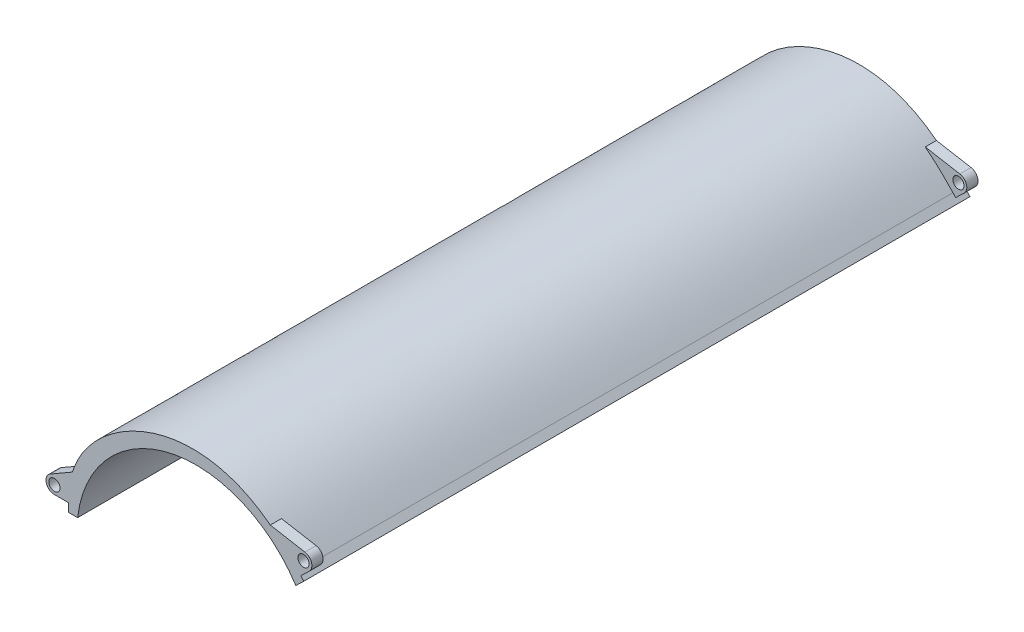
ISO-10303-21;
HEADER;
FILE_DESCRIPTION(('STEP AP214'),'2;1');
FILE_NAME('part.step','',(''),(''),'','','');
FILE_SCHEMA(('AUTOMOTIVE_DESIGN { 1 0 10303 214 1 1 1 1 }'));
ENDSEC;
DATA;
#1=APPLICATION_CONTEXT('core data for automotive mechanical design processes');
#2=APPLICATION_PROTOCOL_DEFINITION('international standard','automotive_design',2000,#1);
#3=PRODUCT_CONTEXT('',#1,'mechanical');
#4=PRODUCT('Part','Part','',(#3));
#5=PRODUCT_RELATED_PRODUCT_CATEGORY('part','',(#4));
#6=PRODUCT_DEFINITION_FORMATION('','',#4);
#7=PRODUCT_DEFINITION_CONTEXT('part definition',#1,'design');
#8=PRODUCT_DEFINITION('design','',#6,#7);
#9=PRODUCT_DEFINITION_SHAPE('','',#8);
#10=(LENGTH_UNIT() NAMED_UNIT(*) SI_UNIT(.MILLI.,.METRE.));
#11=(NAMED_UNIT(*) PLANE_ANGLE_UNIT() SI_UNIT($,.RADIAN.));
#12=(NAMED_UNIT(*) SI_UNIT($,.STERADIAN.) SOLID_ANGLE_UNIT());
#13=UNCERTAINTY_MEASURE_WITH_UNIT(LENGTH_MEASURE(1.E-05),#10,'distance_accuracy_value','');
#14=(GEOMETRIC_REPRESENTATION_CONTEXT(3) GLOBAL_UNCERTAINTY_ASSIGNED_CONTEXT((#13)) GLOBAL_UNIT_ASSIGNED_CONTEXT((#10,
#11,#12)) REPRESENTATION_CONTEXT('',''));
#15=CARTESIAN_POINT('',(0.,0.,0.));
#16=DIRECTION('',(0.,0.,1.));
#17=DIRECTION('',(1.,0.,0.));
#18=AXIS2_PLACEMENT_3D('',#15,#16,#17);
#19=CARTESIAN_POINT('',(-59.3239744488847,128.759639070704,595.));
#20=DIRECTION('',(-0.720870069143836,-0.693070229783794,0.));
#21=DIRECTION('',(0.693070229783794,-0.720870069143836,0.));
#22=AXIS2_PLACEMENT_3D('',#19,#20,#21);
#23=PLANE('',#22);
#24=DIRECTION('',(-0.693070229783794,0.720870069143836,0.));
#25=VECTOR('',#24,1.);
#26=CARTESIAN_POINT('',(-59.3239744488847,128.759639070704,-595.));
#27=LINE('',#26,#25);
#28=CARTESIAN_POINT('',(-59.3239744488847,128.759639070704,-595.));
#29=VERTEX_POINT('',#28);
#30=CARTESIAN_POINT('',(-64.8607561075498,134.51850737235,-595.));
#31=VERTEX_POINT('',#30);
#32=EDGE_CURVE('E464',#29,#31,#27,.T.);
#33=ORIENTED_EDGE('',*,*,#32,.T.);
#34=DIRECTION('',(0.,0.,-1.));
#35=VECTOR('',#34,1.);
#36=CARTESIAN_POINT('',(-64.8607561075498,134.51850737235,-575.));
#37=LINE('',#36,#35);
#38=CARTESIAN_POINT('',(-64.8607561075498,134.51850737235,-575.));
#39=VERTEX_POINT('',#38);
#40=EDGE_CURVE('E57',#39,#31,#37,.T.);
#41=ORIENTED_EDGE('',*,*,#40,.F.);
#42=DIRECTION('',(-0.693070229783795,0.720870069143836,0.));
#43=VECTOR('',#42,1.);
#44=CARTESIAN_POINT('',(-207.944056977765,283.341043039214,-575.));
#45=LINE('',#44,#43);
#46=CARTESIAN_POINT('',(-69.7200278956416,139.572690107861,-575.));
#47=VERTEX_POINT('',#46);
#48=EDGE_CURVE('E215',#39,#47,#45,.T.);
#49=ORIENTED_EDGE('',*,*,#48,.T.);
#50=DIRECTION('',(0.,0.,-1.));
#51=VECTOR('',#50,1.);
#52=CARTESIAN_POINT('',(-69.7200278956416,139.572690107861,595.));
#53=LINE('',#52,#51);
#54=CARTESIAN_POINT('',(-69.7200278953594,139.572690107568,575.));
#55=VERTEX_POINT('',#54);
#56=EDGE_CURVE('E11',#55,#47,#53,.T.);
#57=ORIENTED_EDGE('',*,*,#56,.F.);
#58=DIRECTION('',(0.693070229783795,-0.720870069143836,0.));
#59=VECTOR('',#58,1.);
#60=CARTESIAN_POINT('',(-64.8607561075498,134.51850737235,575.));
#61=LINE('',#60,#59);
#62=CARTESIAN_POINT('',(-64.8607561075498,134.51850737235,575.));
#63=VERTEX_POINT('',#62);
#64=EDGE_CURVE('E439',#55,#63,#61,.T.);
#65=ORIENTED_EDGE('',*,*,#64,.T.);
#66=DIRECTION('',(0.,0.,1.));
#67=VECTOR('',#66,1.);
#68=CARTESIAN_POINT('',(-64.8607561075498,134.51850737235,575.));
#69=LINE('',#68,#67);
#70=CARTESIAN_POINT('',(-64.8607561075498,134.51850737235,595.));
#71=VERTEX_POINT('',#70);
#72=EDGE_CURVE('E414',#63,#71,#69,.T.);
#73=ORIENTED_EDGE('',*,*,#72,.T.);
#74=DIRECTION('',(-0.693070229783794,0.720870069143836,0.));
#75=VECTOR('',#74,1.);
#76=CARTESIAN_POINT('',(-59.3239744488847,128.759639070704,595.));
#77=LINE('',#76,#75);
#78=CARTESIAN_POINT('',(-59.3239744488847,128.759639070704,595.));
#79=VERTEX_POINT('',#78);
#80=EDGE_CURVE('E331',#79,#71,#77,.T.);
#81=ORIENTED_EDGE('',*,*,#80,.F.);
#82=DIRECTION('',(0.,0.,-1.));
#83=VECTOR('',#82,1.);
#84=CARTESIAN_POINT('',(-59.3239744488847,128.759639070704,595.));
#85=LINE('',#84,#83);
#86=EDGE_CURVE('E503',#79,#29,#85,.T.);
#87=ORIENTED_EDGE('',*,*,#86,.T.);
#88=EDGE_LOOP('',(#33,#41,#49,#57,#65,#73,#81,#87));
#89=FACE_BOUND('',#88,.T.);
#90=ADVANCED_FACE('F41',(#89),#23,.F.);
#91=CARTESIAN_POINT('',(-69.7200278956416,139.572690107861,595.));
#92=CARTESIAN_POINT('',(-108.187547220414,179.583185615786,595.));
#93=CARTESIAN_POINT('',(-152.416815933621,225.58654086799,595.));
#94=CARTESIAN_POINT('',(-219.133886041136,251.435560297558,595.));
#95=CARTESIAN_POINT('',(-287.408844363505,253.328836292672,595.));
#96=CARTESIAN_POINT('',(-359.356081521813,236.563554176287,595.));
#97=CARTESIAN_POINT('',(-477.15378099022,170.567422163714,595.));
#98=CARTESIAN_POINT('',(-479.524287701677,50.,595.));
#99=B_SPLINE_CURVE_WITH_KNOTS('',7,(#91,#92,#93,#94,#95,#96,#97,#98),.UNSPECIFIED.,.F.,.F.,(8,
8),(0.,1.),.UNSPECIFIED.);
#100=DIRECTION('',(0.,0.,-1.));
#101=VECTOR('',#100,1.);
#102=SURFACE_OF_LINEAR_EXTRUSION('',#99,#101);
#103=CARTESIAN_POINT('',(-119.307330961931,185.688881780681,-575.));
#104=CARTESIAN_POINT('',(-111.333957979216,179.561593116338,-575.));
#105=CARTESIAN_POINT('',(-103.683856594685,173.1559041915,-575.));
#106=CARTESIAN_POINT('',(-96.3532676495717,166.535005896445,-575.));
#107=CARTESIAN_POINT('',(-89.3294022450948,159.772367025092,-575.));
#108=CARTESIAN_POINT('',(-82.5854794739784,152.954189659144,-575.));
#109=CARTESIAN_POINT('',(-76.0741492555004,146.181682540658,-575.));
#110=CARTESIAN_POINT('',(-69.7200278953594,139.572690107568,-575.));
#111=B_SPLINE_CURVE_WITH_KNOTS('',7,(#103,#104,#105,#106,#107,#108,#109,#110),.UNSPECIFIED.,.F.,
.F.,(8,8),(0.,1.),.UNSPECIFIED.);
#112=CARTESIAN_POINT('',(-119.307330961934,185.688881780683,-575.));
#113=VERTEX_POINT('',#112);
#114=EDGE_CURVE('E64',#113,#47,#111,.T.);
#115=ORIENTED_EDGE('',*,*,#114,.F.);
#116=CARTESIAN_POINT('',(-119.307330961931,185.688881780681,-575.));
#117=DIRECTION('',(0.,0.,-1.));
#118=VECTOR('',#117,1.);
#119=LINE('',#116,#118);
#120=CARTESIAN_POINT('',(-119.307330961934,185.688881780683,-595.));
#121=VERTEX_POINT('',#120);
#122=EDGE_CURVE('E203',#113,#121,#119,.T.);
#123=ORIENTED_EDGE('',*,*,#122,.T.);
#124=CARTESIAN_POINT('',(-69.7200278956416,139.572690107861,-595.));
#125=CARTESIAN_POINT('',(-108.187547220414,179.583185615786,-595.));
#126=CARTESIAN_POINT('',(-152.416815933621,225.58654086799,-595.));
#127=CARTESIAN_POINT('',(-219.133886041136,251.435560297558,-595.));
#128=CARTESIAN_POINT('',(-287.408844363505,253.328836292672,-595.));
#129=CARTESIAN_POINT('',(-359.356081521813,236.563554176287,-595.));
#130=CARTESIAN_POINT('',(-477.15378099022,170.567422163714,-595.));
#131=CARTESIAN_POINT('',(-479.524287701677,50.,-595.));
#132=B_SPLINE_CURVE_WITH_KNOTS('',7,(#124,#125,#126,#127,#128,#129,#130,#131),.UNSPECIFIED.,.F.,
.F.,(8,8),(0.,1.),.UNSPECIFIED.);
#133=CARTESIAN_POINT('',(-472.826933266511,90.8956367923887,-595.));
#134=VERTEX_POINT('',#133);
#135=EDGE_CURVE('E515',#121,#134,#132,.T.);
#136=ORIENTED_EDGE('',*,*,#135,.T.);
#137=DIRECTION('',(0.,0.,-1.));
#138=VECTOR('',#137,1.);
#139=CARTESIAN_POINT('',(-472.826933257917,90.8956368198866,-575.));
#140=LINE('',#139,#138);
#141=CARTESIAN_POINT('',(-472.82693326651,90.8956367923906,-575.));
#142=VERTEX_POINT('',#141);
#143=EDGE_CURVE('E413',#142,#134,#140,.T.);
#144=ORIENTED_EDGE('',*,*,#143,.F.);
#145=CARTESIAN_POINT('',(-479.524287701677,50.0000000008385,-575.));
#146=CARTESIAN_POINT('',(-479.40077470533,56.2820507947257,-575.));
#147=CARTESIAN_POINT('',(-478.963896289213,62.4159497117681,-575.));
#148=CARTESIAN_POINT('',(-478.236465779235,68.4024521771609,-575.));
#149=CARTESIAN_POINT('',(-477.239796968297,74.2424995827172,-575.));
#150=CARTESIAN_POINT('',(-475.993797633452,79.9371958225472,-575.));
#151=CARTESIAN_POINT('',(-474.517057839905,85.4877859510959,-575.));
#152=CARTESIAN_POINT('',(-472.826933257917,90.8956368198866,-575.));
#153=B_SPLINE_CURVE_WITH_KNOTS('',7,(#145,#146,#147,#148,#149,#150,#151,#152),.UNSPECIFIED.,.F.,
.F.,(8,8),(0.,1.),.UNSPECIFIED.);
#154=CARTESIAN_POINT('',(-479.524287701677,50.,-575.));
#155=VERTEX_POINT('',#154);
#156=EDGE_CURVE('E393',#155,#142,#153,.T.);
#157=ORIENTED_EDGE('',*,*,#156,.F.);
#158=DIRECTION('',(0.,0.,-1.));
#159=VECTOR('',#158,1.);
#160=CARTESIAN_POINT('',(-479.524287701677,50.,595.));
#161=LINE('',#160,#159);
#162=CARTESIAN_POINT('',(-479.524287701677,50.0000000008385,575.));
#163=VERTEX_POINT('',#162);
#164=EDGE_CURVE('E49',#163,#155,#161,.T.);
#165=ORIENTED_EDGE('',*,*,#164,.F.);
#166=CARTESIAN_POINT('',(-479.524287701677,50.0000000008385,575.));
#167=CARTESIAN_POINT('',(-479.40077470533,56.2820507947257,575.));
#168=CARTESIAN_POINT('',(-478.963896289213,62.4159497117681,575.));
#169=CARTESIAN_POINT('',(-478.236465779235,68.4024521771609,575.));
#170=CARTESIAN_POINT('',(-477.239796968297,74.2424995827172,575.));
#171=CARTESIAN_POINT('',(-475.993797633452,79.9371958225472,575.));
#172=CARTESIAN_POINT('',(-474.517057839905,85.4877859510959,575.));
#173=CARTESIAN_POINT('',(-472.826933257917,90.8956368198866,575.));
#174=B_SPLINE_CURVE_WITH_KNOTS('',7,(#166,#167,#168,#169,#170,#171,#172,#173),.UNSPECIFIED.,.F.,
.F.,(8,8),(0.94789595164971,1.),.UNSPECIFIED.);
#175=CARTESIAN_POINT('',(-472.826933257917,90.8956368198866,575.));
#176=VERTEX_POINT('',#175);
#177=EDGE_CURVE('E301',#163,#176,#174,.T.);
#178=ORIENTED_EDGE('',*,*,#177,.T.);
#179=CARTESIAN_POINT('',(-472.826933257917,90.8956368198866,575.));
#180=DIRECTION('',(0.,0.,1.));
#181=VECTOR('',#180,1.);
#182=LINE('',#179,#181);
#183=CARTESIAN_POINT('',(-472.826933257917,90.8956368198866,595.));
#184=VERTEX_POINT('',#183);
#185=EDGE_CURVE('E465',#176,#184,#182,.T.);
#186=ORIENTED_EDGE('',*,*,#185,.T.);
#187=CARTESIAN_POINT('',(-119.307330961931,185.688881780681,595.));
#188=VERTEX_POINT('',#187);
#189=EDGE_CURVE('E328',#188,#184,#99,.T.);
#190=ORIENTED_EDGE('',*,*,#189,.F.);
#191=DIRECTION('',(0.,0.,1.));
#192=VECTOR('',#191,1.);
#193=CARTESIAN_POINT('',(-119.307330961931,185.688881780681,575.));
#194=LINE('',#193,#192);
#195=CARTESIAN_POINT('',(-119.307330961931,185.688881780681,575.));
#196=VERTEX_POINT('',#195);
#197=EDGE_CURVE('E422',#196,#188,#194,.T.);
#198=ORIENTED_EDGE('',*,*,#197,.F.);
#199=CARTESIAN_POINT('',(-119.307330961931,185.688881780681,575.));
#200=CARTESIAN_POINT('',(-111.333957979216,179.561593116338,575.));
#201=CARTESIAN_POINT('',(-103.683856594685,173.1559041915,575.));
#202=CARTESIAN_POINT('',(-96.3532676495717,166.535005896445,575.));
#203=CARTESIAN_POINT('',(-89.3294022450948,159.772367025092,575.));
#204=CARTESIAN_POINT('',(-82.5854794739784,152.954189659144,575.));
#205=CARTESIAN_POINT('',(-76.0741492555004,146.181682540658,575.));
#206=CARTESIAN_POINT('',(-69.7200278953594,139.572690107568,575.));
#207=B_SPLINE_CURVE_WITH_KNOTS('',7,(#199,#200,#201,#202,#203,#204,#205,#206),.UNSPECIFIED.,.F.,
.F.,(8,8),(0.,0.165181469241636),.UNSPECIFIED.);
#208=EDGE_CURVE('E548',#196,#55,#207,.T.);
#209=ORIENTED_EDGE('',*,*,#208,.T.);
#210=ORIENTED_EDGE('',*,*,#56,.T.);
#211=EDGE_LOOP('',(#115,#123,#136,#144,#157,#165,#178,#186,#190,#198,#209,#210));
#212=FACE_BOUND('',#211,.T.);
#213=ADVANCED_FACE('F345',(#212),#102,.F.);
#214=CARTESIAN_POINT('',(-479.524287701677,25.,595.));
#215=DIRECTION('',(1.,0.,0.));
#216=DIRECTION('',(0.,1.,0.));
#217=AXIS2_PLACEMENT_3D('',#214,#215,#216);
#218=PLANE('',#217);
#219=DIRECTION('',(0.,-1.,0.));
#220=VECTOR('',#219,1.);
#221=CARTESIAN_POINT('',(-479.524287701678,234.472912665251,-575.));
#222=LINE('',#221,#220);
#223=CARTESIAN_POINT('',(-479.524287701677,40.,-575.));
#224=VERTEX_POINT('',#223);
#225=EDGE_CURVE('E399',#155,#224,#222,.T.);
#226=ORIENTED_EDGE('',*,*,#225,.T.);
#227=DIRECTION('',(0.,0.,-1.));
#228=VECTOR('',#227,1.);
#229=CARTESIAN_POINT('',(-479.524287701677,40.,-575.));
#230=LINE('',#229,#228);
#231=CARTESIAN_POINT('',(-479.524287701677,40.,-595.));
#232=VERTEX_POINT('',#231);
#233=EDGE_CURVE('E406',#224,#232,#230,.T.);
#234=ORIENTED_EDGE('',*,*,#233,.T.);
#235=DIRECTION('',(0.,-1.,0.));
#236=VECTOR('',#235,1.);
#237=CARTESIAN_POINT('',(-479.524287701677,25.,-595.));
#238=LINE('',#237,#236);
#239=CARTESIAN_POINT('',(-479.524287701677,25.,-595.));
#240=VERTEX_POINT('',#239);
#241=EDGE_CURVE('E513',#232,#240,#238,.T.);
#242=ORIENTED_EDGE('',*,*,#241,.T.);
#243=DIRECTION('',(0.,0.,-1.));
#244=VECTOR('',#243,1.);
#245=CARTESIAN_POINT('',(-479.524287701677,25.,595.));
#246=LINE('',#245,#244);
#247=CARTESIAN_POINT('',(-479.524287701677,25.,595.));
#248=VERTEX_POINT('',#247);
#249=EDGE_CURVE('E491',#248,#240,#246,.T.);
#250=ORIENTED_EDGE('',*,*,#249,.F.);
#251=DIRECTION('',(0.,-1.,0.));
#252=VECTOR('',#251,1.);
#253=CARTESIAN_POINT('',(-479.524287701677,25.,595.));
#254=LINE('',#253,#252);
#255=CARTESIAN_POINT('',(-479.524287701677,40.,595.));
#256=VERTEX_POINT('',#255);
#257=EDGE_CURVE('E330',#256,#248,#254,.T.);
#258=ORIENTED_EDGE('',*,*,#257,.F.);
#259=DIRECTION('',(0.,0.,1.));
#260=VECTOR('',#259,1.);
#261=CARTESIAN_POINT('',(-479.524287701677,40.,575.));
#262=LINE('',#261,#260);
#263=CARTESIAN_POINT('',(-479.524287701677,40.,575.));
#264=VERTEX_POINT('',#263);
#265=EDGE_CURVE('E466',#264,#256,#262,.T.);
#266=ORIENTED_EDGE('',*,*,#265,.F.);
#267=DIRECTION('',(0.,1.,0.));
#268=VECTOR('',#267,1.);
#269=CARTESIAN_POINT('',(-479.524287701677,50.0000000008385,575.));
#270=LINE('',#269,#268);
#271=EDGE_CURVE('E310',#264,#163,#270,.T.);
#272=ORIENTED_EDGE('',*,*,#271,.T.);
#273=ORIENTED_EDGE('',*,*,#164,.T.);
#274=EDGE_LOOP('',(#226,#234,#242,#250,#258,#266,#272,#273));
#275=FACE_BOUND('',#274,.T.);
#276=ADVANCED_FACE('F349',(#275),#218,.F.);
#277=CARTESIAN_POINT('',(-463.524287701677,25.,595.));
#278=DIRECTION('',(0.,1.,0.));
#279=DIRECTION('',(0.,0.,1.));
#280=AXIS2_PLACEMENT_3D('',#277,#278,#279);
#281=PLANE('',#280);
#282=DIRECTION('',(1.,0.,0.));
#283=VECTOR('',#282,1.);
#284=CARTESIAN_POINT('',(-463.524287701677,25.,-595.));
#285=LINE('',#284,#283);
#286=CARTESIAN_POINT('',(-463.524287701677,25.0000000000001,-595.));
#287=VERTEX_POINT('',#286);
#288=EDGE_CURVE('E511',#240,#287,#285,.T.);
#289=ORIENTED_EDGE('',*,*,#288,.T.);
#290=DIRECTION('',(0.,0.,-1.));
#291=VECTOR('',#290,1.);
#292=CARTESIAN_POINT('',(-463.524287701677,25.0000000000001,595.));
#293=LINE('',#292,#291);
#294=CARTESIAN_POINT('',(-463.524287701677,25.0000000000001,595.));
#295=VERTEX_POINT('',#294);
#296=EDGE_CURVE('E497',#295,#287,#293,.T.);
#297=ORIENTED_EDGE('',*,*,#296,.F.);
#298=DIRECTION('',(1.,0.,0.));
#299=VECTOR('',#298,1.);
#300=CARTESIAN_POINT('',(-463.524287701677,25.,595.));
#301=LINE('',#300,#299);
#302=EDGE_CURVE('E590',#248,#295,#301,.T.);
#303=ORIENTED_EDGE('',*,*,#302,.F.);
#304=ORIENTED_EDGE('',*,*,#249,.T.);
#305=EDGE_LOOP('',(#289,#297,#303,#304));
#306=FACE_BOUND('',#305,.T.);
#307=ADVANCED_FACE('F589',(#306),#281,.F.);
#308=CARTESIAN_POINT('',(-252.5,1.52655665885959E-13,595.));
#309=DIRECTION('',(0.,0.,-1.));
#310=DIRECTION('',(-1.,0.,0.));
#311=AXIS2_PLACEMENT_3D('',#308,#309,#310);
#312=CYLINDRICAL_SURFACE('',#311,212.5);
#313=CARTESIAN_POINT('',(-252.5,1.52655665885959E-13,-595.));
#314=DIRECTION('',(0.,0.,-1.));
#315=DIRECTION('',(1.,0.,0.));
#316=AXIS2_PLACEMENT_3D('',#313,#314,#315);
#317=CIRCLE('',#316,212.5);
#318=CARTESIAN_POINT('',(-73.7413758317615,114.898234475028,-595.));
#319=VERTEX_POINT('',#318);
#320=EDGE_CURVE('E509',#287,#319,#317,.T.);
#321=ORIENTED_EDGE('',*,*,#320,.T.);
#322=DIRECTION('',(0.,0.,-1.));
#323=VECTOR('',#322,1.);
#324=CARTESIAN_POINT('',(-73.7413758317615,114.898234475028,595.));
#325=LINE('',#324,#323);
#326=CARTESIAN_POINT('',(-73.7413758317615,114.898234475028,595.));
#327=VERTEX_POINT('',#326);
#328=EDGE_CURVE('E500',#327,#319,#325,.T.);
#329=ORIENTED_EDGE('',*,*,#328,.F.);
#330=CARTESIAN_POINT('',(-252.5,1.52655665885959E-13,595.));
#331=DIRECTION('',(0.,0.,-1.));
#332=DIRECTION('',(1.,0.,0.));
#333=AXIS2_PLACEMENT_3D('',#330,#331,#332);
#334=CIRCLE('',#333,212.5);
#335=EDGE_CURVE('E585',#295,#327,#334,.T.);
#336=ORIENTED_EDGE('',*,*,#335,.F.);
#337=ORIENTED_EDGE('',*,*,#296,.T.);
#338=EDGE_LOOP('',(#321,#329,#336,#337));
#339=FACE_BOUND('',#338,.T.);
#340=ADVANCED_FACE('F584',(#339),#312,.F.);
#341=CARTESIAN_POINT('',(-59.3239744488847,128.759639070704,595.));
#342=DIRECTION('',(-0.693070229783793,0.720870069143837,0.));
#343=DIRECTION('',(-0.720870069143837,-0.693070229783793,0.));
#344=AXIS2_PLACEMENT_3D('',#341,#342,#343);
#345=PLANE('',#344);
#346=DIRECTION('',(0.720870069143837,0.693070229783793,0.));
#347=VECTOR('',#346,1.);
#348=CARTESIAN_POINT('',(-59.3239744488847,128.759639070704,-595.));
#349=LINE('',#348,#347);
#350=EDGE_CURVE('E507',#319,#29,#349,.T.);
#351=ORIENTED_EDGE('',*,*,#350,.T.);
#352=ORIENTED_EDGE('',*,*,#86,.F.);
#353=DIRECTION('',(0.720870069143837,0.693070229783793,0.));
#354=VECTOR('',#353,1.);
#355=CARTESIAN_POINT('',(-59.3239744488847,128.759639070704,595.));
#356=LINE('',#355,#354);
#357=EDGE_CURVE('E506',#327,#79,#356,.T.);
#358=ORIENTED_EDGE('',*,*,#357,.F.);
#359=ORIENTED_EDGE('',*,*,#328,.T.);
#360=EDGE_LOOP('',(#351,#352,#358,#359));
#361=FACE_BOUND('',#360,.T.);
#362=ADVANCED_FACE('F580',(#361),#345,.F.);
#363=CARTESIAN_POINT('',(-258.772343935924,234.472912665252,595.));
#364=DIRECTION('',(0.,0.,-1.));
#365=DIRECTION('',(-1.,0.,0.));
#366=AXIS2_PLACEMENT_3D('',#363,#364,#365);
#367=PLANE('',#366);
#368=DIRECTION('',(-0.984807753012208,0.173648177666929,0.));
#369=VECTOR('',#368,1.);
#370=CARTESIAN_POINT('',(-57.3952773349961,174.772116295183,595.));
#371=LINE('',#370,#369);
#372=CARTESIAN_POINT('',(-57.3952773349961,174.772116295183,595.));
#373=VERTEX_POINT('',#372);
#374=EDGE_CURVE('E427',#373,#188,#371,.T.);
#375=ORIENTED_EDGE('',*,*,#374,.T.);
#376=ORIENTED_EDGE('',*,*,#189,.T.);
#377=DIRECTION('',(-0.866025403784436,-0.500000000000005,0.));
#378=VECTOR('',#377,1.);
#379=CARTESIAN_POINT('',(-512.5,67.9903810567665,595.));
#380=LINE('',#379,#378);
#381=CARTESIAN_POINT('',(-512.5,67.9903810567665,595.));
#382=VERTEX_POINT('',#381);
#383=EDGE_CURVE('E455',#184,#382,#380,.T.);
#384=ORIENTED_EDGE('',*,*,#383,.T.);
#385=CARTESIAN_POINT('',(-505.,55.,595.));
#386=DIRECTION('',(0.,0.,1.));
#387=DIRECTION('',(1.,0.,0.));
#388=AXIS2_PLACEMENT_3D('',#385,#386,#387);
#389=CIRCLE('',#388,15.);
#390=CARTESIAN_POINT('',(-505.,40.,595.));
#391=VERTEX_POINT('',#390);
#392=EDGE_CURVE('E449',#382,#391,#389,.T.);
#393=ORIENTED_EDGE('',*,*,#392,.T.);
#394=DIRECTION('',(1.,0.,0.));
#395=VECTOR('',#394,1.);
#396=CARTESIAN_POINT('',(-505.,40.,595.));
#397=LINE('',#396,#395);
#398=EDGE_CURVE('E460',#391,#256,#397,.T.);
#399=ORIENTED_EDGE('',*,*,#398,.T.);
#400=ORIENTED_EDGE('',*,*,#257,.T.);
#401=ORIENTED_EDGE('',*,*,#302,.T.);
#402=ORIENTED_EDGE('',*,*,#335,.T.);
#403=ORIENTED_EDGE('',*,*,#357,.T.);
#404=ORIENTED_EDGE('',*,*,#80,.T.);
#405=DIRECTION('',(0.720870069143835,0.693070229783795,0.));
#406=VECTOR('',#405,1.);
#407=CARTESIAN_POINT('',(-49.6039465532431,149.186948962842,595.));
#408=LINE('',#407,#406);
#409=CARTESIAN_POINT('',(-49.6039465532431,149.186948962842,595.));
#410=VERTEX_POINT('',#409);
#411=EDGE_CURVE('E426',#71,#410,#408,.T.);
#412=ORIENTED_EDGE('',*,*,#411,.T.);
#413=CARTESIAN_POINT('',(-60.0000000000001,160.,595.));
#414=DIRECTION('',(0.,0.,1.));
#415=DIRECTION('',(1.,0.,0.));
#416=AXIS2_PLACEMENT_3D('',#413,#414,#415);
#417=CIRCLE('',#416,15.);
#418=EDGE_CURVE('E423',#410,#373,#417,.T.);
#419=ORIENTED_EDGE('',*,*,#418,.T.);
#420=EDGE_LOOP('',(#375,#376,#384,#393,#399,#400,#401,#402,#403,#404,#412,#419));
#421=FACE_BOUND('',#420,.T.);
#422=CARTESIAN_POINT('',(-505.,55.,595.));
#423=DIRECTION('',(0.,0.,1.));
#424=DIRECTION('',(1.,0.,0.));
#425=AXIS2_PLACEMENT_3D('',#422,#423,#424);
#426=CIRCLE('',#425,9.99999999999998);
#427=CARTESIAN_POINT('',(-495.,55.,595.));
#428=VERTEX_POINT('',#427);
#429=EDGE_CURVE('E443',#428,#428,#426,.T.);
#430=ORIENTED_EDGE('',*,*,#429,.F.);
#431=EDGE_LOOP('',(#430));
#432=FACE_BOUND('',#431,.T.);
#433=CARTESIAN_POINT('',(-60.0000000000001,160.,595.));
#434=DIRECTION('',(0.,0.,1.));
#435=DIRECTION('',(1.,0.,0.));
#436=AXIS2_PLACEMENT_3D('',#433,#434,#435);
#437=CIRCLE('',#436,9.99999999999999);
#438=CARTESIAN_POINT('',(-50.0000000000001,160.,595.));
#439=VERTEX_POINT('',#438);
#440=EDGE_CURVE('E440',#439,#439,#437,.T.);
#441=ORIENTED_EDGE('',*,*,#440,.F.);
#442=EDGE_LOOP('',(#441));
#443=FACE_BOUND('',#442,.T.);
#444=ADVANCED_FACE('F479',(#421,#432,#443),#367,.F.);
#445=CARTESIAN_POINT('',(-258.772343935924,234.472912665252,-595.));
#446=DIRECTION('',(0.,0.,-1.));
#447=DIRECTION('',(-1.,0.,0.));
#448=AXIS2_PLACEMENT_3D('',#445,#446,#447);
#449=PLANE('',#448);
#450=ORIENTED_EDGE('',*,*,#135,.F.);
#451=DIRECTION('',(0.984807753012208,-0.173648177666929,0.));
#452=VECTOR('',#451,1.);
#453=CARTESIAN_POINT('',(-262.909519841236,211.009822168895,-595.));
#454=LINE('',#453,#452);
#455=CARTESIAN_POINT('',(-57.395277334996,174.772116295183,-595.));
#456=VERTEX_POINT('',#455);
#457=EDGE_CURVE('E227',#121,#456,#454,.T.);
#458=ORIENTED_EDGE('',*,*,#457,.T.);
#459=CARTESIAN_POINT('',(-60.0000000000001,160.,-595.));
#460=DIRECTION('',(0.,0.,-1.));
#461=DIRECTION('',(-1.,0.,0.));
#462=AXIS2_PLACEMENT_3D('',#459,#460,#461);
#463=CIRCLE('',#462,15.);
#464=CARTESIAN_POINT('',(-49.6039465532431,149.186948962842,-595.));
#465=VERTEX_POINT('',#464);
#466=EDGE_CURVE('E197',#456,#465,#463,.T.);
#467=ORIENTED_EDGE('',*,*,#466,.T.);
#468=DIRECTION('',(-0.720870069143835,-0.693070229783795,0.));
#469=VECTOR('',#468,1.);
#470=CARTESIAN_POINT('',(-115.689043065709,85.6503769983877,-595.));
#471=LINE('',#470,#469);
#472=EDGE_CURVE('E369',#465,#31,#471,.T.);
#473=ORIENTED_EDGE('',*,*,#472,.T.);
#474=ORIENTED_EDGE('',*,*,#32,.F.);
#475=ORIENTED_EDGE('',*,*,#350,.F.);
#476=ORIENTED_EDGE('',*,*,#320,.F.);
#477=ORIENTED_EDGE('',*,*,#288,.F.);
#478=ORIENTED_EDGE('',*,*,#241,.F.);
#479=DIRECTION('',(-1.,0.,0.));
#480=VECTOR('',#479,1.);
#481=CARTESIAN_POINT('',(-258.772343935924,40.,-595.));
#482=LINE('',#481,#480);
#483=CARTESIAN_POINT('',(-505.,40.,-595.));
#484=VERTEX_POINT('',#483);
#485=EDGE_CURVE('E403',#232,#484,#482,.T.);
#486=ORIENTED_EDGE('',*,*,#485,.T.);
#487=CARTESIAN_POINT('',(-505.,55.,-595.));
#488=DIRECTION('',(0.,0.,-1.));
#489=DIRECTION('',(-1.,0.,0.));
#490=AXIS2_PLACEMENT_3D('',#487,#488,#489);
#491=CIRCLE('',#490,15.);
#492=CARTESIAN_POINT('',(-512.5,67.9903810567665,-595.));
#493=VERTEX_POINT('',#492);
#494=EDGE_CURVE('E400',#484,#493,#491,.T.);
#495=ORIENTED_EDGE('',*,*,#494,.T.);
#496=DIRECTION('',(0.866025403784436,0.500000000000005,0.));
#497=VECTOR('',#496,1.);
#498=CARTESIAN_POINT('',(-250.115207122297,219.478311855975,-595.));
#499=LINE('',#498,#497);
#500=EDGE_CURVE('E386',#493,#134,#499,.T.);
#501=ORIENTED_EDGE('',*,*,#500,.T.);
#502=EDGE_LOOP('',(#450,#458,#467,#473,#474,#475,#476,#477,#478,#486,#495,#501));
#503=FACE_BOUND('',#502,.T.);
#504=CARTESIAN_POINT('',(-505.,55.,-595.));
#505=DIRECTION('',(0.,0.,-1.));
#506=DIRECTION('',(-1.,0.,0.));
#507=AXIS2_PLACEMENT_3D('',#504,#505,#506);
#508=CIRCLE('',#507,9.99999999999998);
#509=CARTESIAN_POINT('',(-515.,55.,-595.));
#510=VERTEX_POINT('',#509);
#511=EDGE_CURVE('E381',#510,#510,#508,.T.);
#512=ORIENTED_EDGE('',*,*,#511,.F.);
#513=EDGE_LOOP('',(#512));
#514=FACE_BOUND('',#513,.T.);
#515=CARTESIAN_POINT('',(-60.0000000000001,160.,-595.));
#516=DIRECTION('',(0.,0.,-1.));
#517=DIRECTION('',(-1.,0.,0.));
#518=AXIS2_PLACEMENT_3D('',#515,#516,#517);
#519=CIRCLE('',#518,9.99999999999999);
#520=CARTESIAN_POINT('',(-70.,160.,-595.));
#521=VERTEX_POINT('',#520);
#522=EDGE_CURVE('E604',#521,#521,#519,.T.);
#523=ORIENTED_EDGE('',*,*,#522,.F.);
#524=EDGE_LOOP('',(#523));
#525=FACE_BOUND('',#524,.T.);
#526=ADVANCED_FACE('F576',(#503,#514,#525),#449,.T.);
#527=CARTESIAN_POINT('',(-505.,55.,575.));
#528=DIRECTION('',(0.,0.,1.));
#529=DIRECTION('',(1.,0.,0.));
#530=AXIS2_PLACEMENT_3D('',#527,#528,#529);
#531=CYLINDRICAL_SURFACE('',#530,15.);
#532=ORIENTED_EDGE('',*,*,#392,.F.);
#533=DIRECTION('',(0.,0.,1.));
#534=VECTOR('',#533,1.);
#535=CARTESIAN_POINT('',(-512.5,67.9903810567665,575.));
#536=LINE('',#535,#534);
#537=CARTESIAN_POINT('',(-512.5,67.9903810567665,575.));
#538=VERTEX_POINT('',#537);
#539=EDGE_CURVE('E462',#538,#382,#536,.T.);
#540=ORIENTED_EDGE('',*,*,#539,.F.);
#541=CARTESIAN_POINT('',(-505.,55.,575.));
#542=DIRECTION('',(0.,0.,1.));
#543=DIRECTION('',(1.,0.,0.));
#544=AXIS2_PLACEMENT_3D('',#541,#542,#543);
#545=CIRCLE('',#544,15.);
#546=CARTESIAN_POINT('',(-505.,40.,575.));
#547=VERTEX_POINT('',#546);
#548=EDGE_CURVE('E452',#538,#547,#545,.T.);
#549=ORIENTED_EDGE('',*,*,#548,.T.);
#550=DIRECTION('',(0.,0.,1.));
#551=VECTOR('',#550,1.);
#552=CARTESIAN_POINT('',(-505.,40.,575.));
#553=LINE('',#552,#551);
#554=EDGE_CURVE('E320',#547,#391,#553,.T.);
#555=ORIENTED_EDGE('',*,*,#554,.T.);
#556=EDGE_LOOP('',(#532,#540,#549,#555));
#557=FACE_BOUND('',#556,.T.);
#558=ADVANCED_FACE('F292',(#557),#531,.T.);
#559=CARTESIAN_POINT('',(-512.5,67.9903810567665,575.));
#560=DIRECTION('',(-0.500000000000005,0.866025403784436,0.));
#561=DIRECTION('',(-0.866025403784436,-0.500000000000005,0.));
#562=AXIS2_PLACEMENT_3D('',#559,#560,#561);
#563=PLANE('',#562);
#564=ORIENTED_EDGE('',*,*,#383,.F.);
#565=ORIENTED_EDGE('',*,*,#185,.F.);
#566=DIRECTION('',(-0.866025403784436,-0.500000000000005,0.));
#567=VECTOR('',#566,1.);
#568=CARTESIAN_POINT('',(-512.5,67.9903810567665,575.));
#569=LINE('',#568,#567);
#570=EDGE_CURVE('E309',#176,#538,#569,.T.);
#571=ORIENTED_EDGE('',*,*,#570,.T.);
#572=ORIENTED_EDGE('',*,*,#539,.T.);
#573=EDGE_LOOP('',(#564,#565,#571,#572));
#574=FACE_BOUND('',#573,.T.);
#575=ADVANCED_FACE('F288',(#574),#563,.T.);
#576=CARTESIAN_POINT('',(-505.,40.,575.));
#577=DIRECTION('',(0.,-1.,0.));
#578=DIRECTION('',(0.,0.,-1.));
#579=AXIS2_PLACEMENT_3D('',#576,#577,#578);
#580=PLANE('',#579);
#581=ORIENTED_EDGE('',*,*,#398,.F.);
#582=ORIENTED_EDGE('',*,*,#554,.F.);
#583=DIRECTION('',(1.,0.,0.));
#584=VECTOR('',#583,1.);
#585=CARTESIAN_POINT('',(-505.,40.,575.));
#586=LINE('',#585,#584);
#587=EDGE_CURVE('E325',#547,#264,#586,.T.);
#588=ORIENTED_EDGE('',*,*,#587,.T.);
#589=ORIENTED_EDGE('',*,*,#265,.T.);
#590=EDGE_LOOP('',(#581,#582,#588,#589));
#591=FACE_BOUND('',#590,.T.);
#592=ADVANCED_FACE('F286',(#591),#580,.T.);
#593=CARTESIAN_POINT('',(-505.,55.,575.));
#594=DIRECTION('',(0.,0.,1.));
#595=DIRECTION('',(1.,0.,0.));
#596=AXIS2_PLACEMENT_3D('',#593,#594,#595);
#597=PLANE('',#596);
#598=CARTESIAN_POINT('',(-505.,55.,575.));
#599=DIRECTION('',(0.,0.,1.));
#600=DIRECTION('',(1.,0.,0.));
#601=AXIS2_PLACEMENT_3D('',#598,#599,#600);
#602=CIRCLE('',#601,9.99999999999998);
#603=CARTESIAN_POINT('',(-495.,55.,575.));
#604=VERTEX_POINT('',#603);
#605=EDGE_CURVE('E446',#604,#604,#602,.T.);
#606=ORIENTED_EDGE('',*,*,#605,.T.);
#607=EDGE_LOOP('',(#606));
#608=FACE_BOUND('',#607,.T.);
#609=ORIENTED_EDGE('',*,*,#548,.F.);
#610=ORIENTED_EDGE('',*,*,#570,.F.);
#611=ORIENTED_EDGE('',*,*,#177,.F.);
#612=ORIENTED_EDGE('',*,*,#271,.F.);
#613=ORIENTED_EDGE('',*,*,#587,.F.);
#614=EDGE_LOOP('',(#609,#610,#611,#612,#613));
#615=FACE_BOUND('',#614,.T.);
#616=ADVANCED_FACE('F282',(#608,#615),#597,.F.);
#617=CARTESIAN_POINT('',(-505.,55.,575.));
#618=DIRECTION('',(0.,0.,1.));
#619=DIRECTION('',(1.,0.,0.));
#620=AXIS2_PLACEMENT_3D('',#617,#618,#619);
#621=CYLINDRICAL_SURFACE('',#620,9.99999999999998);
#622=ORIENTED_EDGE('',*,*,#605,.F.);
#623=EDGE_LOOP('',(#622));
#624=FACE_BOUND('',#623,.T.);
#625=ORIENTED_EDGE('',*,*,#429,.T.);
#626=EDGE_LOOP('',(#625));
#627=FACE_BOUND('',#626,.T.);
#628=ADVANCED_FACE('F272',(#624,#627),#621,.F.);
#629=CARTESIAN_POINT('',(-57.3952773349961,174.772116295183,575.));
#630=DIRECTION('',(0.173648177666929,0.984807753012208,0.));
#631=DIRECTION('',(-0.984807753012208,0.173648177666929,0.));
#632=AXIS2_PLACEMENT_3D('',#629,#630,#631);
#633=PLANE('',#632);
#634=ORIENTED_EDGE('',*,*,#374,.F.);
#635=DIRECTION('',(0.,0.,1.));
#636=VECTOR('',#635,1.);
#637=CARTESIAN_POINT('',(-57.3952773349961,174.772116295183,575.));
#638=LINE('',#637,#636);
#639=CARTESIAN_POINT('',(-57.3952773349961,174.772116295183,575.));
#640=VERTEX_POINT('',#639);
#641=EDGE_CURVE('E420',#640,#373,#638,.T.);
#642=ORIENTED_EDGE('',*,*,#641,.F.);
#643=DIRECTION('',(-0.984807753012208,0.173648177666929,0.));
#644=VECTOR('',#643,1.);
#645=CARTESIAN_POINT('',(-57.3952773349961,174.772116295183,575.));
#646=LINE('',#645,#644);
#647=EDGE_CURVE('E417',#640,#196,#646,.T.);
#648=ORIENTED_EDGE('',*,*,#647,.T.);
#649=ORIENTED_EDGE('',*,*,#197,.T.);
#650=EDGE_LOOP('',(#634,#642,#648,#649));
#651=FACE_BOUND('',#650,.T.);
#652=ADVANCED_FACE('F268',(#651),#633,.T.);
#653=CARTESIAN_POINT('',(-60.0000000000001,160.,575.));
#654=DIRECTION('',(0.,0.,1.));
#655=DIRECTION('',(1.,0.,0.));
#656=AXIS2_PLACEMENT_3D('',#653,#654,#655);
#657=CYLINDRICAL_SURFACE('',#656,15.);
#658=ORIENTED_EDGE('',*,*,#418,.F.);
#659=DIRECTION('',(0.,0.,1.));
#660=VECTOR('',#659,1.);
#661=CARTESIAN_POINT('',(-49.6039465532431,149.186948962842,575.));
#662=LINE('',#661,#660);
#663=CARTESIAN_POINT('',(-49.6039465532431,149.186948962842,575.));
#664=VERTEX_POINT('',#663);
#665=EDGE_CURVE('E418',#664,#410,#662,.T.);
#666=ORIENTED_EDGE('',*,*,#665,.F.);
#667=CARTESIAN_POINT('',(-60.0000000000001,160.,575.));
#668=DIRECTION('',(0.,0.,1.));
#669=DIRECTION('',(1.,0.,0.));
#670=AXIS2_PLACEMENT_3D('',#667,#668,#669);
#671=CIRCLE('',#670,15.);
#672=EDGE_CURVE('E433',#664,#640,#671,.T.);
#673=ORIENTED_EDGE('',*,*,#672,.T.);
#674=ORIENTED_EDGE('',*,*,#641,.T.);
#675=EDGE_LOOP('',(#658,#666,#673,#674));
#676=FACE_BOUND('',#675,.T.);
#677=ADVANCED_FACE('F264',(#676),#657,.T.);
#678=CARTESIAN_POINT('',(-49.6039465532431,149.186948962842,575.));
#679=DIRECTION('',(0.693070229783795,-0.720870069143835,0.));
#680=DIRECTION('',(0.720870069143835,0.693070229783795,0.));
#681=AXIS2_PLACEMENT_3D('',#678,#679,#680);
#682=PLANE('',#681);
#683=ORIENTED_EDGE('',*,*,#411,.F.);
#684=ORIENTED_EDGE('',*,*,#72,.F.);
#685=DIRECTION('',(0.720870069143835,0.693070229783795,0.));
#686=VECTOR('',#685,1.);
#687=CARTESIAN_POINT('',(-49.6039465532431,149.186948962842,575.));
#688=LINE('',#687,#686);
#689=EDGE_CURVE('E436',#63,#664,#688,.T.);
#690=ORIENTED_EDGE('',*,*,#689,.T.);
#691=ORIENTED_EDGE('',*,*,#665,.T.);
#692=EDGE_LOOP('',(#683,#684,#690,#691));
#693=FACE_BOUND('',#692,.T.);
#694=ADVANCED_FACE('F260',(#693),#682,.T.);
#695=CARTESIAN_POINT('',(-93.058075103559,163.082300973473,575.));
#696=DIRECTION('',(0.,0.,-1.));
#697=DIRECTION('',(-1.,0.,0.));
#698=AXIS2_PLACEMENT_3D('',#695,#696,#697);
#699=PLANE('',#698);
#700=CARTESIAN_POINT('',(-60.0000000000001,160.,575.));
#701=DIRECTION('',(0.,0.,1.));
#702=DIRECTION('',(1.,0.,0.));
#703=AXIS2_PLACEMENT_3D('',#700,#701,#702);
#704=CIRCLE('',#703,9.99999999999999);
#705=CARTESIAN_POINT('',(-50.0000000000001,160.,575.));
#706=VERTEX_POINT('',#705);
#707=EDGE_CURVE('E430',#706,#706,#704,.T.);
#708=ORIENTED_EDGE('',*,*,#707,.T.);
#709=EDGE_LOOP('',(#708));
#710=FACE_BOUND('',#709,.T.);
#711=ORIENTED_EDGE('',*,*,#208,.F.);
#712=ORIENTED_EDGE('',*,*,#647,.F.);
#713=ORIENTED_EDGE('',*,*,#672,.F.);
#714=ORIENTED_EDGE('',*,*,#689,.F.);
#715=ORIENTED_EDGE('',*,*,#64,.F.);
#716=EDGE_LOOP('',(#711,#712,#713,#714,#715));
#717=FACE_BOUND('',#716,.T.);
#718=ADVANCED_FACE('F263',(#710,#717),#699,.T.);
#719=CARTESIAN_POINT('',(-60.0000000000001,160.,575.));
#720=DIRECTION('',(0.,0.,1.));
#721=DIRECTION('',(1.,0.,0.));
#722=AXIS2_PLACEMENT_3D('',#719,#720,#721);
#723=CYLINDRICAL_SURFACE('',#722,9.99999999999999);
#724=ORIENTED_EDGE('',*,*,#707,.F.);
#725=EDGE_LOOP('',(#724));
#726=FACE_BOUND('',#725,.T.);
#727=ORIENTED_EDGE('',*,*,#440,.T.);
#728=EDGE_LOOP('',(#727));
#729=FACE_BOUND('',#728,.T.);
#730=ADVANCED_FACE('F258',(#726,#729),#723,.F.);
#731=CARTESIAN_POINT('',(-250.115207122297,219.478311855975,-575.));
#732=DIRECTION('',(-0.500000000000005,0.866025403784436,0.));
#733=DIRECTION('',(-0.866025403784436,-0.500000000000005,0.));
#734=AXIS2_PLACEMENT_3D('',#731,#732,#733);
#735=PLANE('',#734);
#736=ORIENTED_EDGE('',*,*,#500,.F.);
#737=DIRECTION('',(0.,0.,-1.));
#738=VECTOR('',#737,1.);
#739=CARTESIAN_POINT('',(-512.5,67.9903810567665,-575.));
#740=LINE('',#739,#738);
#741=CARTESIAN_POINT('',(-512.5,67.9903810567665,-575.));
#742=VERTEX_POINT('',#741);
#743=EDGE_CURVE('E411',#742,#493,#740,.T.);
#744=ORIENTED_EDGE('',*,*,#743,.F.);
#745=DIRECTION('',(0.866025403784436,0.500000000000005,0.));
#746=VECTOR('',#745,1.);
#747=CARTESIAN_POINT('',(-250.115207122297,219.478311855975,-575.));
#748=LINE('',#747,#746);
#749=EDGE_CURVE('E389',#742,#142,#748,.T.);
#750=ORIENTED_EDGE('',*,*,#749,.T.);
#751=ORIENTED_EDGE('',*,*,#143,.T.);
#752=EDGE_LOOP('',(#736,#744,#750,#751));
#753=FACE_BOUND('',#752,.T.);
#754=ADVANCED_FACE('F254',(#753),#735,.T.);
#755=CARTESIAN_POINT('',(-505.,55.,-575.));
#756=DIRECTION('',(0.,0.,-1.));
#757=DIRECTION('',(-1.,0.,0.));
#758=AXIS2_PLACEMENT_3D('',#755,#756,#757);
#759=CYLINDRICAL_SURFACE('',#758,15.);
#760=ORIENTED_EDGE('',*,*,#494,.F.);
#761=DIRECTION('',(0.,0.,-1.));
#762=VECTOR('',#761,1.);
#763=CARTESIAN_POINT('',(-505.,40.,-575.));
#764=LINE('',#763,#762);
#765=CARTESIAN_POINT('',(-505.,40.,-575.));
#766=VERTEX_POINT('',#765);
#767=EDGE_CURVE('E409',#766,#484,#764,.T.);
#768=ORIENTED_EDGE('',*,*,#767,.F.);
#769=CARTESIAN_POINT('',(-505.,55.,-575.));
#770=DIRECTION('',(0.,0.,-1.));
#771=DIRECTION('',(-1.,0.,0.));
#772=AXIS2_PLACEMENT_3D('',#769,#770,#771);
#773=CIRCLE('',#772,15.);
#774=EDGE_CURVE('E392',#766,#742,#773,.T.);
#775=ORIENTED_EDGE('',*,*,#774,.T.);
#776=ORIENTED_EDGE('',*,*,#743,.T.);
#777=EDGE_LOOP('',(#760,#768,#775,#776));
#778=FACE_BOUND('',#777,.T.);
#779=ADVANCED_FACE('F250',(#778),#759,.T.);
#780=CARTESIAN_POINT('',(-258.772343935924,40.,-575.));
#781=DIRECTION('',(0.,-1.,0.));
#782=DIRECTION('',(0.,0.,-1.));
#783=AXIS2_PLACEMENT_3D('',#780,#781,#782);
#784=PLANE('',#783);
#785=ORIENTED_EDGE('',*,*,#485,.F.);
#786=ORIENTED_EDGE('',*,*,#233,.F.);
#787=DIRECTION('',(-1.,0.,0.));
#788=VECTOR('',#787,1.);
#789=CARTESIAN_POINT('',(-258.772343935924,40.,-575.));
#790=LINE('',#789,#788);
#791=EDGE_CURVE('E396',#224,#766,#790,.T.);
#792=ORIENTED_EDGE('',*,*,#791,.T.);
#793=ORIENTED_EDGE('',*,*,#767,.T.);
#794=EDGE_LOOP('',(#785,#786,#792,#793));
#795=FACE_BOUND('',#794,.T.);
#796=ADVANCED_FACE('F246',(#795),#784,.T.);
#797=CARTESIAN_POINT('',(-477.54341263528,71.2130770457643,-575.));
#798=DIRECTION('',(0.,0.,1.));
#799=DIRECTION('',(1.,0.,0.));
#800=AXIS2_PLACEMENT_3D('',#797,#798,#799);
#801=PLANE('',#800);
#802=CARTESIAN_POINT('',(-505.,55.,-575.));
#803=DIRECTION('',(0.,0.,-1.));
#804=DIRECTION('',(-1.,0.,0.));
#805=AXIS2_PLACEMENT_3D('',#802,#803,#804);
#806=CIRCLE('',#805,9.99999999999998);
#807=CARTESIAN_POINT('',(-515.,55.,-575.));
#808=VERTEX_POINT('',#807);
#809=EDGE_CURVE('E383',#808,#808,#806,.T.);
#810=ORIENTED_EDGE('',*,*,#809,.T.);
#811=EDGE_LOOP('',(#810));
#812=FACE_BOUND('',#811,.T.);
#813=ORIENTED_EDGE('',*,*,#156,.T.);
#814=ORIENTED_EDGE('',*,*,#749,.F.);
#815=ORIENTED_EDGE('',*,*,#774,.F.);
#816=ORIENTED_EDGE('',*,*,#791,.F.);
#817=ORIENTED_EDGE('',*,*,#225,.F.);
#818=EDGE_LOOP('',(#813,#814,#815,#816,#817));
#819=FACE_BOUND('',#818,.T.);
#820=ADVANCED_FACE('F242',(#812,#819),#801,.T.);
#821=CARTESIAN_POINT('',(-505.,55.,-575.));
#822=DIRECTION('',(0.,0.,-1.));
#823=DIRECTION('',(-1.,0.,0.));
#824=AXIS2_PLACEMENT_3D('',#821,#822,#823);
#825=CYLINDRICAL_SURFACE('',#824,9.99999999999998);
#826=ORIENTED_EDGE('',*,*,#809,.F.);
#827=EDGE_LOOP('',(#826));
#828=FACE_BOUND('',#827,.T.);
#829=ORIENTED_EDGE('',*,*,#511,.T.);
#830=EDGE_LOOP('',(#829));
#831=FACE_BOUND('',#830,.T.);
#832=ADVANCED_FACE('F238',(#828,#831),#825,.F.);
#833=CARTESIAN_POINT('',(-115.689043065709,85.6503769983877,-575.));
#834=DIRECTION('',(0.693070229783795,-0.720870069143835,0.));
#835=DIRECTION('',(0.720870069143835,0.693070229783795,0.));
#836=AXIS2_PLACEMENT_3D('',#833,#834,#835);
#837=PLANE('',#836);
#838=ORIENTED_EDGE('',*,*,#472,.F.);
#839=DIRECTION('',(0.,0.,-1.));
#840=VECTOR('',#839,1.);
#841=CARTESIAN_POINT('',(-49.6039465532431,149.186948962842,-575.));
#842=LINE('',#841,#840);
#843=CARTESIAN_POINT('',(-49.6039465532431,149.186948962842,-575.));
#844=VERTEX_POINT('',#843);
#845=EDGE_CURVE('E202',#844,#465,#842,.T.);
#846=ORIENTED_EDGE('',*,*,#845,.F.);
#847=DIRECTION('',(-0.720870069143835,-0.693070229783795,0.));
#848=VECTOR('',#847,1.);
#849=CARTESIAN_POINT('',(-115.689043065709,85.6503769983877,-575.));
#850=LINE('',#849,#848);
#851=EDGE_CURVE('E210',#844,#39,#850,.T.);
#852=ORIENTED_EDGE('',*,*,#851,.T.);
#853=ORIENTED_EDGE('',*,*,#40,.T.);
#854=EDGE_LOOP('',(#838,#846,#852,#853));
#855=FACE_BOUND('',#854,.T.);
#856=ADVANCED_FACE('F241',(#855),#837,.T.);
#857=CARTESIAN_POINT('',(-60.0000000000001,160.,-575.));
#858=DIRECTION('',(0.,0.,-1.));
#859=DIRECTION('',(-1.,0.,0.));
#860=AXIS2_PLACEMENT_3D('',#857,#858,#859);
#861=CYLINDRICAL_SURFACE('',#860,15.);
#862=ORIENTED_EDGE('',*,*,#466,.F.);
#863=DIRECTION('',(0.,0.,-1.));
#864=VECTOR('',#863,1.);
#865=CARTESIAN_POINT('',(-57.395277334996,174.772116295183,-575.));
#866=LINE('',#865,#864);
#867=CARTESIAN_POINT('',(-57.395277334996,174.772116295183,-575.));
#868=VERTEX_POINT('',#867);
#869=EDGE_CURVE('E191',#868,#456,#866,.T.);
#870=ORIENTED_EDGE('',*,*,#869,.F.);
#871=CARTESIAN_POINT('',(-60.0000000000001,160.,-575.));
#872=DIRECTION('',(0.,0.,-1.));
#873=DIRECTION('',(-1.,0.,0.));
#874=AXIS2_PLACEMENT_3D('',#871,#872,#873);
#875=CIRCLE('',#874,15.);
#876=EDGE_CURVE('E194',#868,#844,#875,.T.);
#877=ORIENTED_EDGE('',*,*,#876,.T.);
#878=ORIENTED_EDGE('',*,*,#845,.T.);
#879=EDGE_LOOP('',(#862,#870,#877,#878));
#880=FACE_BOUND('',#879,.T.);
#881=ADVANCED_FACE('F193',(#880),#861,.T.);
#882=CARTESIAN_POINT('',(-262.909519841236,211.009822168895,-575.));
#883=DIRECTION('',(0.173648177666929,0.984807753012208,0.));
#884=DIRECTION('',(-0.984807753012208,0.173648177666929,0.));
#885=AXIS2_PLACEMENT_3D('',#882,#883,#884);
#886=PLANE('',#885);
#887=ORIENTED_EDGE('',*,*,#457,.F.);
#888=ORIENTED_EDGE('',*,*,#122,.F.);
#889=DIRECTION('',(0.984807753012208,-0.173648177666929,0.));
#890=VECTOR('',#889,1.);
#891=CARTESIAN_POINT('',(-262.909519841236,211.009822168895,-575.));
#892=LINE('',#891,#890);
#893=EDGE_CURVE('E208',#113,#868,#892,.T.);
#894=ORIENTED_EDGE('',*,*,#893,.T.);
#895=ORIENTED_EDGE('',*,*,#869,.T.);
#896=EDGE_LOOP('',(#887,#888,#894,#895));
#897=FACE_BOUND('',#896,.T.);
#898=ADVANCED_FACE('F212',(#897),#886,.T.);
#899=CARTESIAN_POINT('',(-93.058075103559,163.082300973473,-575.));
#900=DIRECTION('',(0.,0.,1.));
#901=DIRECTION('',(1.,0.,0.));
#902=AXIS2_PLACEMENT_3D('',#899,#900,#901);
#903=PLANE('',#902);
#904=CARTESIAN_POINT('',(-60.0000000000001,160.,-575.));
#905=DIRECTION('',(0.,0.,-1.));
#906=DIRECTION('',(-1.,0.,0.));
#907=AXIS2_PLACEMENT_3D('',#904,#905,#906);
#908=CIRCLE('',#907,9.99999999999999);
#909=CARTESIAN_POINT('',(-70.,160.,-575.));
#910=VERTEX_POINT('',#909);
#911=EDGE_CURVE('E607',#910,#910,#908,.T.);
#912=ORIENTED_EDGE('',*,*,#911,.T.);
#913=EDGE_LOOP('',(#912));
#914=FACE_BOUND('',#913,.T.);
#915=ORIENTED_EDGE('',*,*,#48,.F.);
#916=ORIENTED_EDGE('',*,*,#851,.F.);
#917=ORIENTED_EDGE('',*,*,#876,.F.);
#918=ORIENTED_EDGE('',*,*,#893,.F.);
#919=ORIENTED_EDGE('',*,*,#114,.T.);
#920=EDGE_LOOP('',(#915,#916,#917,#918,#919));
#921=FACE_BOUND('',#920,.T.);
#922=ADVANCED_FACE('F207',(#914,#921),#903,.T.);
#923=CARTESIAN_POINT('',(-60.0000000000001,160.,-575.));
#924=DIRECTION('',(0.,0.,-1.));
#925=DIRECTION('',(-1.,0.,0.));
#926=AXIS2_PLACEMENT_3D('',#923,#924,#925);
#927=CYLINDRICAL_SURFACE('',#926,9.99999999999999);
#928=ORIENTED_EDGE('',*,*,#911,.F.);
#929=EDGE_LOOP('',(#928));
#930=FACE_BOUND('',#929,.T.);
#931=ORIENTED_EDGE('',*,*,#522,.T.);
#932=EDGE_LOOP('',(#931));
#933=FACE_BOUND('',#932,.T.);
#934=ADVANCED_FACE('F748',(#930,#933),#927,.F.);
#935=CLOSED_SHELL('',(#90,#213,#276,#307,#340,#362,#444,#526,#558,#575,#592,#616,#628,#652,#677,
#694,#718,#730,#754,#779,#796,#820,#832,#856,#881,#898,#922,#934));
#936=MANIFOLD_SOLID_BREP('B2',#935);
#937=ADVANCED_BREP_SHAPE_REPRESENTATION('',(#18,#936),#14);
#938=SHAPE_DEFINITION_REPRESENTATION(#9,#937);
ENDSEC;
END-ISO-10303-21;
